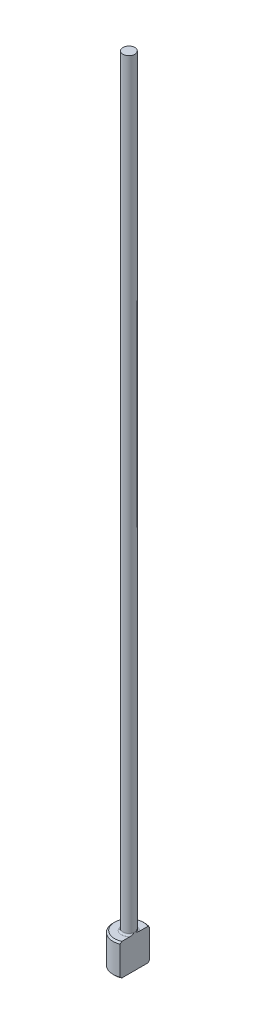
ISO-10303-21;
HEADER;
FILE_DESCRIPTION(('STEP AP214'),'2;1');
FILE_NAME('part.step','',(''),(''),'','','');
FILE_SCHEMA(('AUTOMOTIVE_DESIGN { 1 0 10303 214 1 1 1 1 }'));
ENDSEC;
DATA;
#1=APPLICATION_CONTEXT('core data for automotive mechanical design processes');
#2=APPLICATION_PROTOCOL_DEFINITION('international standard','automotive_design',2000,#1);
#3=PRODUCT_CONTEXT('',#1,'mechanical');
#4=PRODUCT('Part','Part','',(#3));
#5=PRODUCT_RELATED_PRODUCT_CATEGORY('part','',(#4));
#6=PRODUCT_DEFINITION_FORMATION('','',#4);
#7=PRODUCT_DEFINITION_CONTEXT('part definition',#1,'design');
#8=PRODUCT_DEFINITION('design','',#6,#7);
#9=PRODUCT_DEFINITION_SHAPE('','',#8);
#10=(LENGTH_UNIT() NAMED_UNIT(*) SI_UNIT(.MILLI.,.METRE.));
#11=(NAMED_UNIT(*) PLANE_ANGLE_UNIT() SI_UNIT($,.RADIAN.));
#12=(NAMED_UNIT(*) SI_UNIT($,.STERADIAN.) SOLID_ANGLE_UNIT());
#13=UNCERTAINTY_MEASURE_WITH_UNIT(LENGTH_MEASURE(1.E-05),#10,'distance_accuracy_value','');
#14=(GEOMETRIC_REPRESENTATION_CONTEXT(3) GLOBAL_UNCERTAINTY_ASSIGNED_CONTEXT((#13)) GLOBAL_UNIT_ASSIGNED_CONTEXT((#10,
#11,#12)) REPRESENTATION_CONTEXT('',''));
#15=CARTESIAN_POINT('',(0.,0.,0.));
#16=DIRECTION('',(0.,0.,1.));
#17=DIRECTION('',(1.,0.,0.));
#18=AXIS2_PLACEMENT_3D('',#15,#16,#17);
#19=CARTESIAN_POINT('',(0.,0.,0.));
#20=DIRECTION('',(0.,-1.,0.));
#21=DIRECTION('',(0.,0.,-1.));
#22=AXIS2_PLACEMENT_3D('',#19,#20,#21);
#23=PLANE('',#22);
#24=CARTESIAN_POINT('',(0.,0.,0.));
#25=DIRECTION('',(0.,-1.,0.));
#26=DIRECTION('',(0.,0.,-1.));
#27=AXIS2_PLACEMENT_3D('',#24,#25,#26);
#28=CIRCLE('',#27,1.79999999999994);
#29=CARTESIAN_POINT('',(0.749999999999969,0.,1.63630681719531));
#30=VERTEX_POINT('',#29);
#31=CARTESIAN_POINT('',(0.749999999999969,0.,-1.63630681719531));
#32=VERTEX_POINT('',#31);
#33=EDGE_CURVE('E98',#30,#32,#28,.T.);
#34=ORIENTED_EDGE('',*,*,#33,.T.);
#35=DIRECTION('',(0.,0.,1.));
#36=VECTOR('',#35,1.);
#37=CARTESIAN_POINT('',(0.749999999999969,0.,1.85404962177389));
#38=LINE('',#37,#36);
#39=EDGE_CURVE('E83',#32,#30,#38,.T.);
#40=ORIENTED_EDGE('',*,*,#39,.T.);
#41=EDGE_LOOP('',(#34,#40));
#42=FACE_BOUND('',#41,.T.);
#43=ADVANCED_FACE('F32',(#42),#23,.T.);
#44=CARTESIAN_POINT('',(0.,259.958771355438,0.));
#45=DIRECTION('',(0.,1.,0.));
#46=DIRECTION('',(0.,0.,1.));
#47=AXIS2_PLACEMENT_3D('',#44,#45,#46);
#48=CYLINDRICAL_SURFACE('',#47,1.99999999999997);
#49=CARTESIAN_POINT('',(0.,3.79999999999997,0.));
#50=DIRECTION('',(0.,1.,0.));
#51=DIRECTION('',(0.,0.,1.));
#52=AXIS2_PLACEMENT_3D('',#49,#50,#51);
#53=CIRCLE('',#52,1.99999999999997);
#54=CARTESIAN_POINT('',(0.749999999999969,3.79999999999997,1.85404962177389));
#55=VERTEX_POINT('',#54);
#56=CARTESIAN_POINT('',(0.749999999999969,3.79999999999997,-1.85404962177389));
#57=VERTEX_POINT('',#56);
#58=EDGE_CURVE('E104',#55,#57,#53,.F.);
#59=ORIENTED_EDGE('',*,*,#58,.T.);
#60=DIRECTION('',(0.,-1.,0.));
#61=VECTOR('',#60,1.);
#62=CARTESIAN_POINT('',(0.749999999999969,100.,-1.85404962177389));
#63=LINE('',#62,#61);
#64=CARTESIAN_POINT('',(0.749999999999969,0.200000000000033,-1.85404962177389));
#65=VERTEX_POINT('',#64);
#66=EDGE_CURVE('E183',#57,#65,#63,.T.);
#67=ORIENTED_EDGE('',*,*,#66,.T.);
#68=CARTESIAN_POINT('',(0.,0.200000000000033,0.));
#69=DIRECTION('',(0.,-1.,0.));
#70=DIRECTION('',(0.,0.,-1.));
#71=AXIS2_PLACEMENT_3D('',#68,#69,#70);
#72=CIRCLE('',#71,1.99999999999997);
#73=CARTESIAN_POINT('',(0.749999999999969,0.200000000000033,1.85404962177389));
#74=VERTEX_POINT('',#73);
#75=EDGE_CURVE('E100',#65,#74,#72,.F.);
#76=ORIENTED_EDGE('',*,*,#75,.T.);
#77=DIRECTION('',(0.,-1.,0.));
#78=VECTOR('',#77,1.);
#79=CARTESIAN_POINT('',(0.749999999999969,100.,1.85404962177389));
#80=LINE('',#79,#78);
#81=EDGE_CURVE('E93',#55,#74,#80,.T.);
#82=ORIENTED_EDGE('',*,*,#81,.F.);
#83=EDGE_LOOP('',(#59,#67,#76,#82));
#84=FACE_BOUND('',#83,.T.);
#85=ADVANCED_FACE('F158',(#84),#48,.T.);
#86=CARTESIAN_POINT('',(-1.99999999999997,4.,0.));
#87=DIRECTION('',(0.,1.,0.));
#88=DIRECTION('',(0.,0.,1.));
#89=AXIS2_PLACEMENT_3D('',#86,#87,#88);
#90=PLANE('',#89);
#91=CARTESIAN_POINT('',(0.,4.,0.));
#92=DIRECTION('',(0.,1.,0.));
#93=DIRECTION('',(0.,0.,1.));
#94=AXIS2_PLACEMENT_3D('',#91,#92,#93);
#95=CIRCLE('',#94,1.79999999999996);
#96=CARTESIAN_POINT('',(0.749999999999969,4.,-1.63630681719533));
#97=VERTEX_POINT('',#96);
#98=CARTESIAN_POINT('',(0.749999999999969,4.,1.63630681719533));
#99=VERTEX_POINT('',#98);
#100=EDGE_CURVE('E178',#97,#99,#95,.T.);
#101=ORIENTED_EDGE('',*,*,#100,.T.);
#102=DIRECTION('',(0.,0.,-1.));
#103=VECTOR('',#102,1.);
#104=CARTESIAN_POINT('',(0.749999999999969,4.,0.));
#105=LINE('',#104,#103);
#106=CARTESIAN_POINT('',(0.749999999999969,3.99999999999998,0.583095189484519));
#107=VERTEX_POINT('',#106);
#108=EDGE_CURVE('E57',#99,#107,#105,.T.);
#109=ORIENTED_EDGE('',*,*,#108,.T.);
#110=CARTESIAN_POINT('',(0.,4.,0.));
#111=DIRECTION('',(0.,1.,0.));
#112=DIRECTION('',(0.,0.,1.));
#113=AXIS2_PLACEMENT_3D('',#110,#111,#112);
#114=CIRCLE('',#113,0.949999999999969);
#115=CARTESIAN_POINT('',(0.749999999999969,3.99999999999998,-0.583095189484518));
#116=VERTEX_POINT('',#115);
#117=EDGE_CURVE('E107',#107,#116,#114,.F.);
#118=ORIENTED_EDGE('',*,*,#117,.T.);
#119=EDGE_CURVE('E136',#116,#97,#105,.T.);
#120=ORIENTED_EDGE('',*,*,#119,.T.);
#121=EDGE_LOOP('',(#101,#109,#118,#120));
#122=FACE_BOUND('',#121,.T.);
#123=ADVANCED_FACE('F147',(#122),#90,.T.);
#124=CARTESIAN_POINT('',(0.,4.,0.));
#125=DIRECTION('',(0.,-1.,0.));
#126=DIRECTION('',(0.,0.,-1.));
#127=AXIS2_PLACEMENT_3D('',#124,#125,#126);
#128=CONICAL_SURFACE('',#127,1.79999999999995,0.785398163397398);
#129=ORIENTED_EDGE('',*,*,#58,.F.);
#130=CARTESIAN_POINT('',(0.749999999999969,1.6493344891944,4.08234297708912));
#131=CARTESIAN_POINT('',(0.749999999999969,1.75686328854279,3.97300940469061));
#132=CARTESIAN_POINT('',(0.749999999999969,1.86432546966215,3.86361021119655));
#133=CARTESIAN_POINT('',(0.749999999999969,2.07918719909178,3.64450528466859));
#134=CARTESIAN_POINT('',(0.749999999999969,2.1865865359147,3.53479934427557));
#135=CARTESIAN_POINT('',(0.749999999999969,2.40330928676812,3.31294195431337));
#136=CARTESIAN_POINT('',(0.749999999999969,2.51262786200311,3.20078577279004));
#137=CARTESIAN_POINT('',(0.749999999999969,2.73079905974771,2.97627027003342));
#138=CARTESIAN_POINT('',(0.749999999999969,2.83965207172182,2.86391132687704));
#139=CARTESIAN_POINT('',(0.749999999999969,3.12410072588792,2.56910579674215));
#140=CARTESIAN_POINT('',(0.749999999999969,3.29932702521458,2.38630095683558));
#141=CARTESIAN_POINT('',(0.749999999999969,3.5608144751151,2.11005080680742));
#142=CARTESIAN_POINT('',(0.749999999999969,3.64793893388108,2.01742399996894));
#143=CARTESIAN_POINT('',(0.749999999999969,3.82126966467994,1.83139888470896));
#144=CARTESIAN_POINT('',(0.749999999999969,3.90747636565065,1.73800097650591));
#145=CARTESIAN_POINT('',(0.749999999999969,4.07705927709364,1.55161637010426));
#146=CARTESIAN_POINT('',(0.749999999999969,4.16045863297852,1.45865087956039));
#147=CARTESIAN_POINT('',(0.749999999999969,4.28399832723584,1.31767418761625));
#148=CARTESIAN_POINT('',(0.749999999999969,4.32495686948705,1.27038111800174));
#149=CARTESIAN_POINT('',(0.749999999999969,4.40612814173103,1.17516037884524));
#150=CARTESIAN_POINT('',(0.749999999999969,4.44634090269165,1.12723273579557));
#151=CARTESIAN_POINT('',(0.749999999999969,4.52542294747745,1.030920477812));
#152=CARTESIAN_POINT('',(0.749999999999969,4.56430041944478,0.982542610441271));
#153=CARTESIAN_POINT('',(0.749999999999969,4.64060877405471,0.884663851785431));
#154=CARTESIAN_POINT('',(0.749999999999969,4.67803993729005,0.835163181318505));
#155=CARTESIAN_POINT('',(0.749999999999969,4.7506421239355,0.734748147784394));
#156=CARTESIAN_POINT('',(0.749999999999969,4.78581957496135,0.683838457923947));
#157=CARTESIAN_POINT('',(0.749999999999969,4.8528147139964,0.579868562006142));
#158=CARTESIAN_POINT('',(0.749999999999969,4.88463648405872,0.52681108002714));
#159=CARTESIAN_POINT('',(0.749999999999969,4.92004236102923,0.460353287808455));
#160=CARTESIAN_POINT('',(0.749999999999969,4.92626425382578,0.44835537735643));
#161=CARTESIAN_POINT('',(0.749999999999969,4.93840821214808,0.42420502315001));
#162=CARTESIAN_POINT('',(0.749999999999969,4.94433019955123,0.412052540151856));
#163=CARTESIAN_POINT('',(0.749999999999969,4.96159246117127,0.375357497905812));
#164=CARTESIAN_POINT('',(0.749999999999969,4.97243059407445,0.350574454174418));
#165=CARTESIAN_POINT('',(0.749999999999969,4.99232429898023,0.300598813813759));
#166=CARTESIAN_POINT('',(0.749999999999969,5.00139743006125,0.27541327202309));
#167=CARTESIAN_POINT('',(0.749999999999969,5.01752532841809,0.22439193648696));
#168=CARTESIAN_POINT('',(0.749999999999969,5.02458006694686,0.198556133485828));
#169=CARTESIAN_POINT('',(0.749999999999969,5.03526259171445,0.150878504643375));
#170=CARTESIAN_POINT('',(0.749999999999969,5.03927292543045,0.129123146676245));
#171=CARTESIAN_POINT('',(0.749999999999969,5.0454699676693,0.0853625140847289));
#172=CARTESIAN_POINT('',(0.749999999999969,5.0476572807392,0.0633573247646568));
#173=CARTESIAN_POINT('',(0.749999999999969,5.05127090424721,-0.00270951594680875));
#174=CARTESIAN_POINT('',(0.749999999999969,5.04978253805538,-0.0469656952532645));
#175=CARTESIAN_POINT('',(0.749999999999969,5.03814860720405,-0.143936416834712));
#176=CARTESIAN_POINT('',(0.749999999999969,5.02621240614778,-0.196426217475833));
#177=CARTESIAN_POINT('',(0.749999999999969,5.00214641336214,-0.273272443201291));
#178=CARTESIAN_POINT('',(0.749999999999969,4.99304774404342,-0.298672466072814));
#179=CARTESIAN_POINT('',(0.749999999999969,4.97317462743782,-0.348806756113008));
#180=CARTESIAN_POINT('',(0.749999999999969,4.96240055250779,-0.373541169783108));
#181=CARTESIAN_POINT('',(0.749999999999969,4.92901260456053,-0.444792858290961));
#182=CARTESIAN_POINT('',(0.749999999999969,4.90460879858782,-0.490464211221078));
#183=CARTESIAN_POINT('',(0.749999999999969,4.85261191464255,-0.579972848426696));
#184=CARTESIAN_POINT('',(0.749999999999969,4.82501493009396,-0.623807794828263));
#185=CARTESIAN_POINT('',(0.749999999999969,4.76759807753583,-0.710209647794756));
#186=CARTESIAN_POINT('',(0.749999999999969,4.73777062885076,-0.752771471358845));
#187=CARTESIAN_POINT('',(0.749999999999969,4.67663657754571,-0.836824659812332));
#188=CARTESIAN_POINT('',(0.749999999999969,4.64532962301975,-0.878315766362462));
#189=CARTESIAN_POINT('',(0.749999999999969,4.58120898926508,-0.961064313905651));
#190=CARTESIAN_POINT('',(0.749999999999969,4.54838018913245,-1.00230998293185));
#191=CARTESIAN_POINT('',(0.749999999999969,4.48192435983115,-1.0841546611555));
#192=CARTESIAN_POINT('',(0.749999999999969,4.44829728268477,-1.12475363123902));
#193=CARTESIAN_POINT('',(0.749999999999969,4.34669509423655,-1.24559513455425));
#194=CARTESIAN_POINT('',(0.749999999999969,4.27783379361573,-1.32509096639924));
#195=CARTESIAN_POINT('',(0.749999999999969,4.10242211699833,-1.52396732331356));
#196=CARTESIAN_POINT('',(0.749999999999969,3.99494650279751,-1.64252540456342));
#197=CARTESIAN_POINT('',(0.749999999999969,3.7782504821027,-1.87804575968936));
#198=CARTESIAN_POINT('',(0.749999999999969,3.66902991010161,-1.9950078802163));
#199=CARTESIAN_POINT('',(0.749999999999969,3.449392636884,-2.22808772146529));
#200=CARTESIAN_POINT('',(0.749999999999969,3.33897457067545,-2.3442041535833));
#201=CARTESIAN_POINT('',(0.749999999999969,3.11746229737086,-2.57577975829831));
#202=CARTESIAN_POINT('',(0.749999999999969,3.00636811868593,-2.69123895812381));
#203=CARTESIAN_POINT('',(0.749999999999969,2.79171284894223,-2.91342601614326));
#204=CARTESIAN_POINT('',(0.749999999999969,2.6881840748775,-3.02018512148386));
#205=CARTESIAN_POINT('',(0.749999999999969,2.48083134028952,-3.23341885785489));
#206=CARTESIAN_POINT('',(0.749999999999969,2.37700737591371,-3.33989348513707));
#207=CARTESIAN_POINT('',(0.749999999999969,2.16930389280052,-3.5524591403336));
#208=CARTESIAN_POINT('',(0.749999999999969,2.06542472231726,-3.65855050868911));
#209=CARTESIAN_POINT('',(0.749999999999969,1.857495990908,-3.87056274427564));
#210=CARTESIAN_POINT('',(0.749999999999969,1.75344643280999,-3.97648361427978));
#211=CARTESIAN_POINT('',(0.749999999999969,1.6493344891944,-4.08234297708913));
#212=B_SPLINE_CURVE_WITH_KNOTS('',3,(#130,#131,#132,#133,#134,#135,#136,#137,#138,#139,#140,
#141,#142,#143,#144,#145,#146,#147,#148,#149,#150,#151,#152,#153,#154,#155,#156,#157,#158,#159,
#160,#161,#162,#163,#164,#165,#166,#167,#168,#169,#170,#171,#172,#173,#174,#175,#176,#177,#178,
#179,#180,#181,#182,#183,#184,#185,#186,#187,#188,#189,#190,#191,#192,#193,#194,#195,#196,#197,
#198,#199,#200,#201,#202,#203,#204,#205,#206,#207,#208,#209,#210,#211),.UNSPECIFIED.,.F.,.F.,(4,
2,2,2,2,2,2,2,2,2,2,2,2,2,2,2,2,2,2,2,2,2,2,2,2,2,2,2,2,2,2,2,2,2,2,2,2,2,2,2,4),(0.,
0.460050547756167,0.920626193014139,1.39048289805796,1.859803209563,2.61945882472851,
3.0009434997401,3.38224127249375,3.75689298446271,3.9445792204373,4.13225764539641,
4.31843090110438,4.50456785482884,4.69014785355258,4.87549943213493,4.91604145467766,
4.95659398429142,5.03768920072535,5.11793098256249,5.1981739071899,5.26446717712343,
5.33073845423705,5.46284570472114,5.62332534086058,5.7042256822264,5.78510806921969,
5.94023468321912,6.09555312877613,6.25142580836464,6.40733575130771,6.56546927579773,
6.72361232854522,7.03910022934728,7.51913300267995,7.99921158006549,8.47991142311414,
8.96059120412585,9.40673105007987,9.85287674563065,10.2983160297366,10.743747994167),.UNSPECIFIED.);
#213=EDGE_CURVE('E135',#55,#99,#212,.T.);
#214=ORIENTED_EDGE('',*,*,#213,.T.);
#215=ORIENTED_EDGE('',*,*,#100,.F.);
#216=EDGE_CURVE('E127',#97,#57,#212,.T.);
#217=ORIENTED_EDGE('',*,*,#216,.T.);
#218=EDGE_LOOP('',(#129,#214,#215,#217));
#219=FACE_BOUND('',#218,.T.);
#220=ADVANCED_FACE('F143',(#219),#128,.T.);
#221=CARTESIAN_POINT('',(0.,0.200000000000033,0.));
#222=DIRECTION('',(0.,1.,0.));
#223=DIRECTION('',(0.,0.,1.));
#224=AXIS2_PLACEMENT_3D('',#221,#222,#223);
#225=CONICAL_SURFACE('',#224,1.99999999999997,0.785398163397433);
#226=ORIENTED_EDGE('',*,*,#75,.F.);
#227=CARTESIAN_POINT('',(0.749999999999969,2.35066551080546,-4.08234297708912));
#228=CARTESIAN_POINT('',(0.749999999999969,2.24313671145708,-3.97300940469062));
#229=CARTESIAN_POINT('',(0.749999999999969,2.13567453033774,-3.86361021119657));
#230=CARTESIAN_POINT('',(0.749999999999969,1.92081280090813,-3.64450528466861));
#231=CARTESIAN_POINT('',(0.749999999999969,1.81341346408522,-3.5347993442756));
#232=CARTESIAN_POINT('',(0.749999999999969,1.59669071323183,-3.31294195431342));
#233=CARTESIAN_POINT('',(0.749999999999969,1.48737213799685,-3.20078577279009));
#234=CARTESIAN_POINT('',(0.749999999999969,1.26920094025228,-2.97627027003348));
#235=CARTESIAN_POINT('',(0.749999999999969,1.16034792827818,-2.86391132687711));
#236=CARTESIAN_POINT('',(0.749999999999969,0.875899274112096,-2.56910579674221));
#237=CARTESIAN_POINT('',(0.749999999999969,0.70067297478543,-2.38630095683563));
#238=CARTESIAN_POINT('',(0.749999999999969,0.439185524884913,-2.11005080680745));
#239=CARTESIAN_POINT('',(0.749999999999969,0.352061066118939,-2.01742399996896));
#240=CARTESIAN_POINT('',(0.749999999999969,0.178730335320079,-1.83139888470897));
#241=CARTESIAN_POINT('',(0.749999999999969,0.0925236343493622,-1.73800097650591));
#242=CARTESIAN_POINT('',(0.749999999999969,-0.077059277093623,-1.55161637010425));
#243=CARTESIAN_POINT('',(0.749999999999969,-0.160458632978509,-1.45865087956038));
#244=CARTESIAN_POINT('',(0.749999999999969,-0.283998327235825,-1.31767418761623));
#245=CARTESIAN_POINT('',(0.749999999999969,-0.324956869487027,-1.27038111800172));
#246=CARTESIAN_POINT('',(0.749999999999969,-0.406128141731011,-1.17516037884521));
#247=CARTESIAN_POINT('',(0.749999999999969,-0.446340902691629,-1.12723273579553));
#248=CARTESIAN_POINT('',(0.749999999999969,-0.525422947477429,-1.03092047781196));
#249=CARTESIAN_POINT('',(0.749999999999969,-0.56430041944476,-0.982542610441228));
#250=CARTESIAN_POINT('',(0.749999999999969,-0.640608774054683,-0.884663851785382));
#251=CARTESIAN_POINT('',(0.749999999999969,-0.678039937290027,-0.835163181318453));
#252=CARTESIAN_POINT('',(0.749999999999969,-0.750642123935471,-0.734748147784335));
#253=CARTESIAN_POINT('',(0.749999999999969,-0.785819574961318,-0.683838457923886));
#254=CARTESIAN_POINT('',(0.749999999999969,-0.852814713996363,-0.579868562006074));
#255=CARTESIAN_POINT('',(0.749999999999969,-0.884636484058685,-0.526811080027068));
#256=CARTESIAN_POINT('',(0.749999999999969,-0.920042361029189,-0.46035328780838));
#257=CARTESIAN_POINT('',(0.749999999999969,-0.926264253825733,-0.448355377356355));
#258=CARTESIAN_POINT('',(0.749999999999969,-0.938408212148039,-0.424205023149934));
#259=CARTESIAN_POINT('',(0.749999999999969,-0.94433019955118,-0.412052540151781));
#260=CARTESIAN_POINT('',(0.749999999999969,-0.961592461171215,-0.375357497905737));
#261=CARTESIAN_POINT('',(0.749999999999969,-0.972430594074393,-0.350574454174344));
#262=CARTESIAN_POINT('',(0.749999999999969,-0.992324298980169,-0.300598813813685));
#263=CARTESIAN_POINT('',(0.749999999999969,-1.00139743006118,-0.275413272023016));
#264=CARTESIAN_POINT('',(0.749999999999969,-1.01752532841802,-0.224391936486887));
#265=CARTESIAN_POINT('',(0.749999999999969,-1.02458006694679,-0.198556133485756));
#266=CARTESIAN_POINT('',(0.749999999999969,-1.03526259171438,-0.150878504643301));
#267=CARTESIAN_POINT('',(0.749999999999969,-1.03927292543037,-0.129123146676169));
#268=CARTESIAN_POINT('',(0.749999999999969,-1.04546996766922,-0.0853625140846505));
#269=CARTESIAN_POINT('',(0.749999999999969,-1.04765728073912,-0.063357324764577));
#270=CARTESIAN_POINT('',(0.749999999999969,-1.05127090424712,0.00270951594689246));
#271=CARTESIAN_POINT('',(0.749999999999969,-1.04978253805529,0.0469656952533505));
#272=CARTESIAN_POINT('',(0.749999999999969,-1.03814860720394,0.143936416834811));
#273=CARTESIAN_POINT('',(0.749999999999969,-1.02621240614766,0.196426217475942));
#274=CARTESIAN_POINT('',(0.749999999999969,-1.00214641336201,0.273272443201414));
#275=CARTESIAN_POINT('',(0.749999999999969,-0.993047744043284,0.298672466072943));
#276=CARTESIAN_POINT('',(0.749999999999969,-0.973174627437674,0.348806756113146));
#277=CARTESIAN_POINT('',(0.749999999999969,-0.962400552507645,0.373541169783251));
#278=CARTESIAN_POINT('',(0.749999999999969,-0.929012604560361,0.444792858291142));
#279=CARTESIAN_POINT('',(0.749999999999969,-0.904608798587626,0.490464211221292));
#280=CARTESIAN_POINT('',(0.749999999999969,-0.852611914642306,0.579972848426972));
#281=CARTESIAN_POINT('',(0.749999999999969,-0.825014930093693,0.623807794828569));
#282=CARTESIAN_POINT('',(0.749999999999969,-0.767598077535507,0.710209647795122));
#283=CARTESIAN_POINT('',(0.749999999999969,-0.737770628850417,0.75277147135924));
#284=CARTESIAN_POINT('',(0.749999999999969,-0.676636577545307,0.836824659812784));
#285=CARTESIAN_POINT('',(0.749999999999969,-0.645329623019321,0.878315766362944));
#286=CARTESIAN_POINT('',(0.749999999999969,-0.581208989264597,0.96106431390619));
#287=CARTESIAN_POINT('',(0.749999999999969,-0.548380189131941,1.00230998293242));
#288=CARTESIAN_POINT('',(0.749999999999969,-0.481924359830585,1.08415466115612));
#289=CARTESIAN_POINT('',(0.749999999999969,-0.448297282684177,1.12475363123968));
#290=CARTESIAN_POINT('',(0.749999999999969,-0.346695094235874,1.24559513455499));
#291=CARTESIAN_POINT('',(0.749999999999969,-0.277833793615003,1.32509096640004));
#292=CARTESIAN_POINT('',(0.749999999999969,-0.102422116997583,1.52396732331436));
#293=CARTESIAN_POINT('',(0.749999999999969,0.00505349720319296,1.64252540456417));
#294=CARTESIAN_POINT('',(0.749999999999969,0.221749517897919,1.87804575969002));
#295=CARTESIAN_POINT('',(0.749999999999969,0.330970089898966,1.99500788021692));
#296=CARTESIAN_POINT('',(0.749999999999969,0.55060736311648,2.22808772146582));
#297=CARTESIAN_POINT('',(0.749999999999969,0.661025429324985,2.34420415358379));
#298=CARTESIAN_POINT('',(0.749999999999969,0.88253770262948,2.57577975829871));
#299=CARTESIAN_POINT('',(0.749999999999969,0.993631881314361,2.69123895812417));
#300=CARTESIAN_POINT('',(0.749999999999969,1.20828715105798,2.91342601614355));
#301=CARTESIAN_POINT('',(0.749999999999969,1.31181592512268,3.02018512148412));
#302=CARTESIAN_POINT('',(0.749999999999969,1.5191686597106,3.2334188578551));
#303=CARTESIAN_POINT('',(0.749999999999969,1.62299262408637,3.33989348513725));
#304=CARTESIAN_POINT('',(0.749999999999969,1.8306961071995,3.55245914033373));
#305=CARTESIAN_POINT('',(0.749999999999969,1.93457527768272,3.65855050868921));
#306=CARTESIAN_POINT('',(0.749999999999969,2.14250400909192,3.87056274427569));
#307=CARTESIAN_POINT('',(0.749999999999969,2.2465535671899,3.9764836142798));
#308=CARTESIAN_POINT('',(0.749999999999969,2.35066551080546,4.08234297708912));
#309=B_SPLINE_CURVE_WITH_KNOTS('',3,(#227,#228,#229,#230,#231,#232,#233,#234,#235,#236,#237,
#238,#239,#240,#241,#242,#243,#244,#245,#246,#247,#248,#249,#250,#251,#252,#253,#254,#255,#256,
#257,#258,#259,#260,#261,#262,#263,#264,#265,#266,#267,#268,#269,#270,#271,#272,#273,#274,#275,
#276,#277,#278,#279,#280,#281,#282,#283,#284,#285,#286,#287,#288,#289,#290,#291,#292,#293,#294,
#295,#296,#297,#298,#299,#300,#301,#302,#303,#304,#305,#306,#307,#308),.UNSPECIFIED.,.F.,.F.,(4,
2,2,2,2,2,2,2,2,2,2,2,2,2,2,2,2,2,2,2,2,2,2,2,2,2,2,2,2,2,2,2,2,2,2,2,2,2,2,2,4),(0.,
0.460050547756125,0.920626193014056,1.39048289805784,1.85980320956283,2.61945882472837,
3.00094349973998,3.38224127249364,3.75689298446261,3.94457922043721,4.13225764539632,
4.3184309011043,4.50456785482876,4.69014785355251,4.87549943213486,4.91604145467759,
4.95659398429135,5.03768920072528,5.11793098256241,5.19817390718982,5.26446717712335,
5.33073845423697,5.46284570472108,5.62332534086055,5.70422568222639,5.7851080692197,
5.94023468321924,6.09555312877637,6.251425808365,6.40733575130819,6.56546927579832,
6.72361232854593,7.03910022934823,7.51913300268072,7.99921158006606,8.47991142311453,
8.96059120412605,9.40673105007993,9.85287674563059,10.2983160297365,10.7437479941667),.UNSPECIFIED.);
#310=EDGE_CURVE('E86',#65,#32,#309,.T.);
#311=ORIENTED_EDGE('',*,*,#310,.T.);
#312=ORIENTED_EDGE('',*,*,#33,.F.);
#313=EDGE_CURVE('E89',#30,#74,#309,.T.);
#314=ORIENTED_EDGE('',*,*,#313,.T.);
#315=EDGE_LOOP('',(#226,#311,#312,#314));
#316=FACE_BOUND('',#315,.T.);
#317=ADVANCED_FACE('F97',(#316),#225,.T.);
#318=CARTESIAN_POINT('',(0.,4.19999999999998,0.));
#319=DIRECTION('',(0.,1.,0.));
#320=DIRECTION('',(0.,0.,1.));
#321=AXIS2_PLACEMENT_3D('',#318,#319,#320);
#322=TOROIDAL_SURFACE('',#321,0.949999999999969,0.2);
#323=CARTESIAN_POINT('',(0.749999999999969,4.19999999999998,0.));
#324=CARTESIAN_POINT('',(0.749999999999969,4.20000052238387,0.));
#325=CARTESIAN_POINT('',(0.749999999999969,4.20000104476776,-7.92518434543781E-08));
#326=CARTESIAN_POINT('',(0.749999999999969,4.20000206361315,-3.453450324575E-07));
#327=CARTESIAN_POINT('',(0.749999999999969,4.20000255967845,-5.33493155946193E-07));
#328=CARTESIAN_POINT('',(0.749999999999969,4.20000354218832,-9.91557928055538E-07));
#329=CARTESIAN_POINT('',(0.749999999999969,4.20000402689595,-1.26510932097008E-06));
#330=CARTESIAN_POINT('',(0.749999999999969,4.20000495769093,-1.86638897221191E-06));
#331=CARTESIAN_POINT('',(0.749999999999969,4.20000540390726,-2.19392467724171E-06));
#332=CARTESIAN_POINT('',(0.749999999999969,4.20000683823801,-3.3337095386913E-06));
#333=CARTESIAN_POINT('',(0.749999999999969,4.20000776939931,-4.21820144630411E-06));
#334=CARTESIAN_POINT('',(0.749999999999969,4.20000948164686,-6.08403167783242E-06));
#335=CARTESIAN_POINT('',(0.749999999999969,4.20001026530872,-7.06314146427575E-06));
#336=CARTESIAN_POINT('',(0.749999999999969,4.20001305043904,-1.07283300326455E-05));
#337=CARTESIAN_POINT('',(0.749999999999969,4.20001489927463,-1.35334971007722E-05));
#338=CARTESIAN_POINT('',(0.749999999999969,4.20001806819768,-1.91887701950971E-05));
#339=CARTESIAN_POINT('',(0.749999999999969,4.20001941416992,-2.20250298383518E-05));
#340=CARTESIAN_POINT('',(0.749999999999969,4.20002483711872,-3.36357626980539E-05));
#341=CARTESIAN_POINT('',(0.749999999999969,4.20002876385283,-4.24755662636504E-05));
#342=CARTESIAN_POINT('',(0.749999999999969,4.20003535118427,-5.93015819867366E-05));
#343=CARTESIAN_POINT('',(0.749999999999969,4.20003811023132,-6.72480837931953E-05));
#344=CARTESIAN_POINT('',(0.749999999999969,4.20005910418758,-0.000122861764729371));
#345=CARTESIAN_POINT('',(0.749999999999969,4.2000847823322,-0.000167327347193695));
#346=CARTESIAN_POINT('',(0.749999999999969,4.20017912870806,-0.00033728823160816));
#347=CARTESIAN_POINT('',(0.749999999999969,4.20024226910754,-0.000465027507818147));
#348=CARTESIAN_POINT('',(0.749999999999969,4.20048606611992,-0.000950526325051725));
#349=CARTESIAN_POINT('',(0.749999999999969,4.20067249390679,-0.00130597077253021));
#350=CARTESIAN_POINT('',(0.749999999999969,4.20141452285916,-0.00272815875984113));
#351=CARTESIAN_POINT('',(0.749999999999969,4.20196367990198,-0.00379745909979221));
#352=CARTESIAN_POINT('',(0.749999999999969,4.21079317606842,-0.0209810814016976));
#353=CARTESIAN_POINT('',(0.749999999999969,4.21912708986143,-0.0370747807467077));
#354=CARTESIAN_POINT('',(0.749999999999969,4.23538169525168,-0.0687945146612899));
#355=CARTESIAN_POINT('',(0.749999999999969,4.24330692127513,-0.0844183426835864));
#356=CARTESIAN_POINT('',(0.749999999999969,4.25980152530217,-0.117412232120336));
#357=CARTESIAN_POINT('',(0.749999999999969,4.2683506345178,-0.134792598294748));
#358=CARTESIAN_POINT('',(0.749999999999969,4.28516256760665,-0.169887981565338));
#359=CARTESIAN_POINT('',(0.749999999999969,4.29342203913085,-0.187604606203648));
#360=CARTESIAN_POINT('',(0.749999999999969,4.31367684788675,-0.232718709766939));
#361=CARTESIAN_POINT('',(0.749999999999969,4.32533268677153,-0.260271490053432));
#362=CARTESIAN_POINT('',(0.749999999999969,4.34666110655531,-0.315501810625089));
#363=CARTESIAN_POINT('',(0.749999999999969,4.35636938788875,-0.343165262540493));
#364=CARTESIAN_POINT('',(0.749999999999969,4.37268127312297,-0.396748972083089));
#365=CARTESIAN_POINT('',(0.749999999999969,4.379483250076,-0.42260763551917));
#366=CARTESIAN_POINT('',(0.749999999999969,4.39076706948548,-0.476103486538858));
#367=CARTESIAN_POINT('',(0.749999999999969,4.39512718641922,-0.503767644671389));
#368=CARTESIAN_POINT('',(0.749999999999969,4.40012258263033,-0.559350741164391));
#369=CARTESIAN_POINT('',(0.749999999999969,4.40077276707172,-0.587268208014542));
#370=CARTESIAN_POINT('',(0.749999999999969,4.39725531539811,-0.642496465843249));
#371=CARTESIAN_POINT('',(0.749999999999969,4.39315871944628,-0.669810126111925));
#372=CARTESIAN_POINT('',(0.749999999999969,4.38226759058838,-0.710376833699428));
#373=CARTESIAN_POINT('',(0.749999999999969,4.37764112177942,-0.724213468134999));
#374=CARTESIAN_POINT('',(0.749999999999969,4.36645438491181,-0.751128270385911));
#375=CARTESIAN_POINT('',(0.749999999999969,4.3598916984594,-0.764205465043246));
#376=CARTESIAN_POINT('',(0.749999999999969,4.34591711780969,-0.787020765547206));
#377=CARTESIAN_POINT('',(0.749999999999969,4.33882518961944,-0.796953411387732));
#378=CARTESIAN_POINT('',(0.749999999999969,4.32312129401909,-0.815534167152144));
#379=CARTESIAN_POINT('',(0.749999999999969,4.31451194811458,-0.824184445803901));
#380=CARTESIAN_POINT('',(0.749999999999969,4.29770708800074,-0.838172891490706));
#381=CARTESIAN_POINT('',(0.749999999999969,4.2897756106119,-0.843827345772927));
#382=CARTESIAN_POINT('',(0.749999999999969,4.27308433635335,-0.853755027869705));
#383=CARTESIAN_POINT('',(0.749999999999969,4.26432487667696,-0.858028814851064));
#384=CARTESIAN_POINT('',(0.749999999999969,4.24611994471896,-0.864966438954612));
#385=CARTESIAN_POINT('',(0.749999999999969,4.23667052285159,-0.86762003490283));
#386=CARTESIAN_POINT('',(0.749999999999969,4.21743927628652,-0.871086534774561));
#387=CARTESIAN_POINT('',(0.749999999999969,4.207657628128,-0.871900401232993));
#388=CARTESIAN_POINT('',(0.749999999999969,4.18916476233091,-0.871644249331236));
#389=CARTESIAN_POINT('',(0.749999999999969,4.18045031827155,-0.870765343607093));
#390=CARTESIAN_POINT('',(0.749999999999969,4.16329782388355,-0.867547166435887));
#391=CARTESIAN_POINT('',(0.749999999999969,4.15485975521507,-0.865207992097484));
#392=CARTESIAN_POINT('',(0.749999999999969,4.138510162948,-0.859212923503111));
#393=CARTESIAN_POINT('',(0.749999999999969,4.13059660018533,-0.855562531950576));
#394=CARTESIAN_POINT('',(0.749999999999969,4.11540880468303,-0.847119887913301));
#395=CARTESIAN_POINT('',(0.749999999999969,4.10813470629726,-0.842327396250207));
#396=CARTESIAN_POINT('',(0.749999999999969,4.09350795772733,-0.831172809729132));
#397=CARTESIAN_POINT('',(0.749999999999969,4.08624574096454,-0.824692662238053));
#398=CARTESIAN_POINT('',(0.749999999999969,4.07268239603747,-0.810794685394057));
#399=CARTESIAN_POINT('',(0.749999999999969,4.06638225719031,-0.803375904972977));
#400=CARTESIAN_POINT('',(0.749999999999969,4.05147186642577,-0.783446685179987));
#401=CARTESIAN_POINT('',(0.749999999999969,4.04355238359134,-0.770417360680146));
#402=CARTESIAN_POINT('',(0.749999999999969,4.02991429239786,-0.743286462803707));
#403=CARTESIAN_POINT('',(0.749999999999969,4.02419651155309,-0.729184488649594));
#404=CARTESIAN_POINT('',(0.749999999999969,4.01257018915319,-0.693822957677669));
#405=CARTESIAN_POINT('',(0.749999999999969,4.00774380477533,-0.672209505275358));
#406=CARTESIAN_POINT('',(0.749999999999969,4.00145191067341,-0.628298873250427));
#407=CARTESIAN_POINT('',(0.749999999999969,4.0000267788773,-0.605996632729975));
#408=CARTESIAN_POINT('',(0.749999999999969,3.99995578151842,-0.54611119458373));
#409=CARTESIAN_POINT('',(0.749999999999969,4.00388309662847,-0.508527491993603));
#410=CARTESIAN_POINT('',(0.749999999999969,4.01373246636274,-0.453837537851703));
#411=CARTESIAN_POINT('',(0.749999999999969,4.01754666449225,-0.436272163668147));
#412=CARTESIAN_POINT('',(0.749999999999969,4.02621031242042,-0.401484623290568));
#413=CARTESIAN_POINT('',(0.749999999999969,4.03105449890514,-0.38426118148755));
#414=CARTESIAN_POINT('',(0.749999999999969,4.04486296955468,-0.339542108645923));
#415=CARTESIAN_POINT('',(0.749999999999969,4.05452531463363,-0.312264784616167));
#416=CARTESIAN_POINT('',(0.749999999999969,4.07570310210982,-0.257776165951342));
#417=CARTESIAN_POINT('',(0.749999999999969,4.08725400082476,-0.230578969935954));
#418=CARTESIAN_POINT('',(0.749999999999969,4.10733071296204,-0.185975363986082));
#419=CARTESIAN_POINT('',(0.749999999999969,4.11553018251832,-0.168419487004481));
#420=CARTESIAN_POINT('',(0.749999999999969,4.13221303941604,-0.133639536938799));
#421=CARTESIAN_POINT('',(0.749999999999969,4.14069316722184,-0.116413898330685));
#422=CARTESIAN_POINT('',(0.749999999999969,4.15705001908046,-0.0837133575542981));
#423=CARTESIAN_POINT('',(0.749999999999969,4.16490699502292,-0.0682284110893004));
#424=CARTESIAN_POINT('',(0.749999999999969,4.18101978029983,-0.0367899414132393));
#425=CARTESIAN_POINT('',(0.749999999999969,4.18928002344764,-0.0208385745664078));
#426=CARTESIAN_POINT('',(0.749999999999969,4.19803632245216,-0.00379745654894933));
#427=CARTESIAN_POINT('',(0.749999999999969,4.19858548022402,-0.00272815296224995));
#428=CARTESIAN_POINT('',(0.749999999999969,4.1993275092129,-0.00130596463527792));
#429=CARTESIAN_POINT('',(0.749999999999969,4.19951393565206,-0.000950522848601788));
#430=CARTESIAN_POINT('',(0.749999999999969,4.19975773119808,-0.000465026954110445));
#431=CARTESIAN_POINT('',(0.749999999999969,4.19982087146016,-0.00033728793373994));
#432=CARTESIAN_POINT('',(0.749999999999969,4.19991521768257,-0.000167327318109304));
#433=CARTESIAN_POINT('',(0.749999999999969,4.19994089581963,-0.000122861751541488));
#434=CARTESIAN_POINT('',(0.749999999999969,4.19996188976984,-6.72480870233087E-05));
#435=CARTESIAN_POINT('',(0.749999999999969,4.19996464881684,-5.93015850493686E-05));
#436=CARTESIAN_POINT('',(0.749999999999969,4.19997123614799,-4.24755688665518E-05));
#437=CARTESIAN_POINT('',(0.749999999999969,4.19997516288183,-3.36357649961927E-05));
#438=CARTESIAN_POINT('',(0.749999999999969,4.19998058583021,-2.20250315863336E-05));
#439=CARTESIAN_POINT('',(0.749999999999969,4.19998193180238,-1.91887717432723E-05));
#440=CARTESIAN_POINT('',(0.749999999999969,4.1999851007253,-1.35334982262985E-05));
#441=CARTESIAN_POINT('',(0.749999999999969,4.19998694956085,-1.07283309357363E-05));
#442=CARTESIAN_POINT('',(0.749999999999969,4.19998973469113,-7.06314207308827E-06));
#443=CARTESIAN_POINT('',(0.749999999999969,4.19999051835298,-6.08403221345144E-06));
#444=CARTESIAN_POINT('',(0.749999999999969,4.19999223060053,-4.21820183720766E-06));
#445=CARTESIAN_POINT('',(0.749999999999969,4.19999316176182,-3.33370985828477E-06));
#446=CARTESIAN_POINT('',(0.749999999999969,4.19999459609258,-2.19392490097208E-06));
#447=CARTESIAN_POINT('',(0.749999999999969,4.19999504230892,-1.86638916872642E-06));
#448=CARTESIAN_POINT('',(0.749999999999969,4.19999597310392,-1.26510946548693E-06));
#449=CARTESIAN_POINT('',(0.749999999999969,4.19999645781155,-9.91558047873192E-07));
#450=CARTESIAN_POINT('',(0.749999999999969,4.19999744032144,-5.33493231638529E-07));
#451=CARTESIAN_POINT('',(0.749999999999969,4.19999793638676,-3.45345088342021E-07));
#452=CARTESIAN_POINT('',(0.749999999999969,4.19999895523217,-7.92518659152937E-08));
#453=CARTESIAN_POINT('',(0.749999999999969,4.19999947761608,0.));
#454=CARTESIAN_POINT('',(0.749999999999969,4.19999999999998,0.));
#455=B_SPLINE_CURVE_WITH_KNOTS('',3,(#323,#324,#325,#326,#327,#328,#329,#330,#331,#332,#333,
#334,#335,#336,#337,#338,#339,#340,#341,#342,#343,#344,#345,#346,#347,#348,#349,#350,#351,#352,
#353,#354,#355,#356,#357,#358,#359,#360,#361,#362,#363,#364,#365,#366,#367,#368,#369,#370,#371,
#372,#373,#374,#375,#376,#377,#378,#379,#380,#381,#382,#383,#384,#385,#386,#387,#388,#389,#390,
#391,#392,#393,#394,#395,#396,#397,#398,#399,#400,#401,#402,#403,#404,#405,#406,#407,#408,#409,
#410,#411,#412,#413,#414,#415,#416,#417,#418,#419,#420,#421,#422,#423,#424,#425,#426,#427,#428,
#429,#430,#431,#432,#433,#434,#435,#436,#437,#438,#439,#440,#441,#442,#443,#444,#445,#446,#447,
#448,#449,#450,#451,#452,#453,#454),.UNSPECIFIED.,.T.,.F.,(4,2,2,2,2,2,2,2,2,2,2,2,2,2,2,2,2,2,
2,2,2,2,2,2,2,2,2,2,2,2,2,2,2,2,2,2,2,2,2,2,2,2,2,2,2,2,2,2,2,2,2,2,2,2,2,2,2,2,2,2,2,2,2,2,2,
4),(0.,1.56543919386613E-06,3.15006544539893E-06,4.81434341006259E-06,6.47280876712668E-06,
1.03067365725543E-05,1.40657946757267E-05,2.41046687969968E-05,3.35140856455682E-05,
6.25197195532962E-05,8.77289705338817E-05,0.000240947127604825,0.000669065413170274,
0.00187238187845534,0.00547938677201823,0.0598417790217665,0.112399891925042,0.170503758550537,
0.229141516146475,0.318850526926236,0.40672395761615,0.486842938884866,0.570663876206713,
0.654147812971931,0.736398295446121,0.780052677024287,0.823761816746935,0.860241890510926,
0.896659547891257,0.925764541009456,0.954857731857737,0.984132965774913,1.01339287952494,
1.03954157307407,1.06568852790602,1.09172701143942,1.11777095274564,1.14686281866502,
1.17598440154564,1.22146737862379,1.26696743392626,1.33303548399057,1.39988404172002,
1.51253340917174,1.56644503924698,1.62008752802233,1.70682485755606,1.79543193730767,
1.85355663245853,1.91115281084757,1.96324672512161,2.0171283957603,2.02073541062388,
2.0219387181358,2.02236683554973,2.02252005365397,2.02254526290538,2.02257426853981,
2.0225836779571,2.02259371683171,2.02259747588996,2.02260130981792,2.02260296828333,
2.02260463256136,2.02260621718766,2.0226077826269),.UNSPECIFIED.);
#456=CARTESIAN_POINT('',(0.749999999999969,4.19999999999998,0.));
#457=VERTEX_POINT('',#456);
#458=EDGE_CURVE('E11',#116,#457,#455,.T.);
#459=ORIENTED_EDGE('',*,*,#458,.F.);
#460=ORIENTED_EDGE('',*,*,#117,.F.);
#461=CARTESIAN_POINT('',(0.749999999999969,4.19999999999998,0.));
#462=CARTESIAN_POINT('',(0.749999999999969,4.19999947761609,0.));
#463=CARTESIAN_POINT('',(0.749999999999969,4.1999989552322,7.92518434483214E-08));
#464=CARTESIAN_POINT('',(0.749999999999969,4.19999793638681,3.45345032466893E-07));
#465=CARTESIAN_POINT('',(0.749999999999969,4.19999744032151,5.33493155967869E-07));
#466=CARTESIAN_POINT('',(0.749999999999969,4.19999645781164,9.91557928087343E-07));
#467=CARTESIAN_POINT('',(0.749999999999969,4.19999597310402,1.26510932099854E-06));
#468=CARTESIAN_POINT('',(0.749999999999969,4.19999504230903,1.86638897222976E-06));
#469=CARTESIAN_POINT('',(0.749999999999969,4.1999945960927,2.19392467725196E-06));
#470=CARTESIAN_POINT('',(0.749999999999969,4.19999316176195,3.33370953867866E-06));
#471=CARTESIAN_POINT('',(0.749999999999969,4.19999223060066,4.21820144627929E-06));
#472=CARTESIAN_POINT('',(0.749999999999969,4.1999905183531,6.08403167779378E-06));
#473=CARTESIAN_POINT('',(0.749999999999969,4.19998973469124,7.06314146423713E-06));
#474=CARTESIAN_POINT('',(0.749999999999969,4.19998694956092,1.07283300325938E-05));
#475=CARTESIAN_POINT('',(0.749999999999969,4.19998510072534,1.35334971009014E-05));
#476=CARTESIAN_POINT('',(0.749999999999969,4.19998193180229,1.91887701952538E-05));
#477=CARTESIAN_POINT('',(0.749999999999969,4.19998058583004,2.20250298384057E-05));
#478=CARTESIAN_POINT('',(0.749999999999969,4.19997516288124,3.36357626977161E-05));
#479=CARTESIAN_POINT('',(0.749999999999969,4.19997123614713,4.24755662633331E-05));
#480=CARTESIAN_POINT('',(0.749999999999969,4.19996464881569,5.93015819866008E-05));
#481=CARTESIAN_POINT('',(0.749999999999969,4.19996188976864,6.72480837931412E-05));
#482=CARTESIAN_POINT('',(0.749999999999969,4.19994089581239,0.000122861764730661));
#483=CARTESIAN_POINT('',(0.749999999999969,4.19991521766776,0.000167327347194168));
#484=CARTESIAN_POINT('',(0.749999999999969,4.19982087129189,0.000337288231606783));
#485=CARTESIAN_POINT('',(0.749999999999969,4.19975773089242,0.000465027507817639));
#486=CARTESIAN_POINT('',(0.749999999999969,4.19951393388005,0.000950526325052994));
#487=CARTESIAN_POINT('',(0.749999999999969,4.19932750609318,0.00130597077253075));
#488=CARTESIAN_POINT('',(0.749999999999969,4.1985854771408,0.00272815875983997));
#489=CARTESIAN_POINT('',(0.749999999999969,4.19803632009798,0.00379745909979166));
#490=CARTESIAN_POINT('',(0.749999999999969,4.18920682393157,0.0209810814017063));
#491=CARTESIAN_POINT('',(0.749999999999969,4.18087291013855,0.037074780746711));
#492=CARTESIAN_POINT('',(0.749999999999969,4.16461830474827,0.0687945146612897));
#493=CARTESIAN_POINT('',(0.749999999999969,4.15669307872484,0.084418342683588));
#494=CARTESIAN_POINT('',(0.749999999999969,4.14019847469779,0.117412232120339));
#495=CARTESIAN_POINT('',(0.749999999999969,4.13164936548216,0.13479259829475));
#496=CARTESIAN_POINT('',(0.749999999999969,4.11483743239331,0.169887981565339));
#497=CARTESIAN_POINT('',(0.749999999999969,4.10657796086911,0.187604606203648));
#498=CARTESIAN_POINT('',(0.749999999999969,4.08632315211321,0.232718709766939));
#499=CARTESIAN_POINT('',(0.749999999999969,4.07466731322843,0.260271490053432));
#500=CARTESIAN_POINT('',(0.749999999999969,4.05333889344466,0.315501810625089));
#501=CARTESIAN_POINT('',(0.749999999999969,4.04363061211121,0.343165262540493));
#502=CARTESIAN_POINT('',(0.749999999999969,4.02731872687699,0.396748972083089));
#503=CARTESIAN_POINT('',(0.749999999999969,4.02051674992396,0.42260763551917));
#504=CARTESIAN_POINT('',(0.749999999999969,4.00923293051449,0.476103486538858));
#505=CARTESIAN_POINT('',(0.749999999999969,4.00487281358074,0.503767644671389));
#506=CARTESIAN_POINT('',(0.749999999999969,3.99987741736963,0.559350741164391));
#507=CARTESIAN_POINT('',(0.749999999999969,3.99922723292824,0.587268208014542));
#508=CARTESIAN_POINT('',(0.749999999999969,4.00274468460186,0.642496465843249));
#509=CARTESIAN_POINT('',(0.749999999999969,4.00684128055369,0.669810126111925));
#510=CARTESIAN_POINT('',(0.749999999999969,4.01773240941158,0.710376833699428));
#511=CARTESIAN_POINT('',(0.749999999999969,4.02235887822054,0.724213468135));
#512=CARTESIAN_POINT('',(0.749999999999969,4.03354561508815,0.751128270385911));
#513=CARTESIAN_POINT('',(0.749999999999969,4.04010830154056,0.764205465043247));
#514=CARTESIAN_POINT('',(0.749999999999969,4.05408288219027,0.787020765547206));
#515=CARTESIAN_POINT('',(0.749999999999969,4.06117481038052,0.796953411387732));
#516=CARTESIAN_POINT('',(0.749999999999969,4.07687870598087,0.815534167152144));
#517=CARTESIAN_POINT('',(0.749999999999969,4.08548805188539,0.824184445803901));
#518=CARTESIAN_POINT('',(0.749999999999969,4.10229291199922,0.838172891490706));
#519=CARTESIAN_POINT('',(0.749999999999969,4.11022438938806,0.843827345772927));
#520=CARTESIAN_POINT('',(0.749999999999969,4.12691566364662,0.853755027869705));
#521=CARTESIAN_POINT('',(0.749999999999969,4.135675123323,0.858028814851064));
#522=CARTESIAN_POINT('',(0.749999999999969,4.153880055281,0.864966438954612));
#523=CARTESIAN_POINT('',(0.749999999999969,4.16332947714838,0.86762003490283));
#524=CARTESIAN_POINT('',(0.749999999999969,4.18256072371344,0.871086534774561));
#525=CARTESIAN_POINT('',(0.749999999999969,4.19234237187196,0.871900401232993));
#526=CARTESIAN_POINT('',(0.749999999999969,4.21083523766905,0.871644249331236));
#527=CARTESIAN_POINT('',(0.749999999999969,4.21954968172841,0.870765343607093));
#528=CARTESIAN_POINT('',(0.749999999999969,4.23670217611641,0.867547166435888));
#529=CARTESIAN_POINT('',(0.749999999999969,4.2451402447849,0.865207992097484));
#530=CARTESIAN_POINT('',(0.749999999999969,4.26148983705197,0.859212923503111));
#531=CARTESIAN_POINT('',(0.749999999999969,4.26940339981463,0.855562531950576));
#532=CARTESIAN_POINT('',(0.749999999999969,4.28459119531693,0.847119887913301));
#533=CARTESIAN_POINT('',(0.749999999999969,4.2918652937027,0.842327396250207));
#534=CARTESIAN_POINT('',(0.749999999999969,4.30649204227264,0.831172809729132));
#535=CARTESIAN_POINT('',(0.749999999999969,4.31375425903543,0.824692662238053));
#536=CARTESIAN_POINT('',(0.749999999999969,4.32731760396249,0.810794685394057));
#537=CARTESIAN_POINT('',(0.749999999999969,4.33361774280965,0.803375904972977));
#538=CARTESIAN_POINT('',(0.749999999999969,4.34852813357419,0.783446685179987));
#539=CARTESIAN_POINT('',(0.749999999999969,4.35644761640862,0.770417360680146));
#540=CARTESIAN_POINT('',(0.749999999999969,4.3700857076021,0.743286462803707));
#541=CARTESIAN_POINT('',(0.749999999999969,4.37580348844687,0.729184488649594));
#542=CARTESIAN_POINT('',(0.749999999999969,4.38742981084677,0.693822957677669));
#543=CARTESIAN_POINT('',(0.749999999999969,4.39225619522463,0.672209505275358));
#544=CARTESIAN_POINT('',(0.749999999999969,4.39854808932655,0.628298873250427));
#545=CARTESIAN_POINT('',(0.749999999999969,4.39997322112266,0.605996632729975));
#546=CARTESIAN_POINT('',(0.749999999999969,4.40004421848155,0.54611119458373));
#547=CARTESIAN_POINT('',(0.749999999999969,4.3961169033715,0.508527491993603));
#548=CARTESIAN_POINT('',(0.749999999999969,4.38626753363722,0.453837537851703));
#549=CARTESIAN_POINT('',(0.749999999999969,4.38245333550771,0.436272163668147));
#550=CARTESIAN_POINT('',(0.749999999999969,4.37378968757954,0.401484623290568));
#551=CARTESIAN_POINT('',(0.749999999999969,4.36894550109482,0.38426118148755));
#552=CARTESIAN_POINT('',(0.749999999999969,4.35513703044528,0.339542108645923));
#553=CARTESIAN_POINT('',(0.749999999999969,4.34547468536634,0.312264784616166));
#554=CARTESIAN_POINT('',(0.749999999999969,4.32429689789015,0.257776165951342));
#555=CARTESIAN_POINT('',(0.749999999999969,4.3127459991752,0.230578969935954));
#556=CARTESIAN_POINT('',(0.749999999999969,4.29266928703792,0.185975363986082));
#557=CARTESIAN_POINT('',(0.749999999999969,4.28446981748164,0.168419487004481));
#558=CARTESIAN_POINT('',(0.749999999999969,4.26778696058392,0.133639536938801));
#559=CARTESIAN_POINT('',(0.749999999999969,4.25930683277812,0.116413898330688));
#560=CARTESIAN_POINT('',(0.749999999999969,4.2429499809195,0.0837133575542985));
#561=CARTESIAN_POINT('',(0.749999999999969,4.23509300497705,0.0682284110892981));
#562=CARTESIAN_POINT('',(0.749999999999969,4.21898021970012,0.0367899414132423));
#563=CARTESIAN_POINT('',(0.749999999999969,4.2107199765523,0.020838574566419));
#564=CARTESIAN_POINT('',(0.749999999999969,4.20196367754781,0.00379745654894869));
#565=CARTESIAN_POINT('',(0.749999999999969,4.20141451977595,0.00272815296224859));
#566=CARTESIAN_POINT('',(0.749999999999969,4.20067249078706,0.00130596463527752));
#567=CARTESIAN_POINT('',(0.749999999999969,4.2004860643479,0.000950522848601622));
#568=CARTESIAN_POINT('',(0.749999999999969,4.20024226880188,0.00046502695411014));
#569=CARTESIAN_POINT('',(0.749999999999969,4.2001791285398,0.000337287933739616));
#570=CARTESIAN_POINT('',(0.749999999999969,4.20008478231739,0.000167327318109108));
#571=CARTESIAN_POINT('',(0.749999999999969,4.20005910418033,0.000122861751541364));
#572=CARTESIAN_POINT('',(0.749999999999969,4.20003811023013,6.72480870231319E-05));
#573=CARTESIAN_POINT('',(0.749999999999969,4.20003535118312,5.93015850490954E-05));
#574=CARTESIAN_POINT('',(0.749999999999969,4.20002876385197,4.24755688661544E-05));
#575=CARTESIAN_POINT('',(0.749999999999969,4.20002483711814,3.36357649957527E-05));
#576=CARTESIAN_POINT('',(0.749999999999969,4.20001941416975,2.20250315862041E-05));
#577=CARTESIAN_POINT('',(0.749999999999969,4.20001806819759,1.91887717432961E-05));
#578=CARTESIAN_POINT('',(0.749999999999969,4.20001489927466,1.35334982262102E-05));
#579=CARTESIAN_POINT('',(0.749999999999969,4.20001305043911,1.07283309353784E-05));
#580=CARTESIAN_POINT('',(0.749999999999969,4.20001026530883,7.06314207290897E-06));
#581=CARTESIAN_POINT('',(0.749999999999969,4.20000948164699,6.0840322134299E-06));
#582=CARTESIAN_POINT('',(0.749999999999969,4.20000776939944,4.21820183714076E-06));
#583=CARTESIAN_POINT('',(0.749999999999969,4.20000683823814,3.33370985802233E-06));
#584=CARTESIAN_POINT('',(0.749999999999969,4.20000540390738,2.1939249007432E-06));
#585=CARTESIAN_POINT('',(0.749999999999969,4.20000495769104,1.8663891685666E-06));
#586=CARTESIAN_POINT('',(0.749999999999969,4.20000402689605,1.26510946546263E-06));
#587=CARTESIAN_POINT('',(0.749999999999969,4.20000354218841,9.91558047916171E-07));
#588=CARTESIAN_POINT('',(0.749999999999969,4.20000255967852,5.33493231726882E-07));
#589=CARTESIAN_POINT('',(0.749999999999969,4.20000206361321,3.45345088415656E-07));
#590=CARTESIAN_POINT('',(0.749999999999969,4.20000104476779,7.92518659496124E-08));
#591=CARTESIAN_POINT('',(0.749999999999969,4.20000052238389,0.));
#592=CARTESIAN_POINT('',(0.749999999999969,4.19999999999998,0.));
#593=B_SPLINE_CURVE_WITH_KNOTS('',3,(#461,#462,#463,#464,#465,#466,#467,#468,#469,#470,#471,
#472,#473,#474,#475,#476,#477,#478,#479,#480,#481,#482,#483,#484,#485,#486,#487,#488,#489,#490,
#491,#492,#493,#494,#495,#496,#497,#498,#499,#500,#501,#502,#503,#504,#505,#506,#507,#508,#509,
#510,#511,#512,#513,#514,#515,#516,#517,#518,#519,#520,#521,#522,#523,#524,#525,#526,#527,#528,
#529,#530,#531,#532,#533,#534,#535,#536,#537,#538,#539,#540,#541,#542,#543,#544,#545,#546,#547,
#548,#549,#550,#551,#552,#553,#554,#555,#556,#557,#558,#559,#560,#561,#562,#563,#564,#565,#566,
#567,#568,#569,#570,#571,#572,#573,#574,#575,#576,#577,#578,#579,#580,#581,#582,#583,#584,#585,
#586,#587,#588,#589,#590,#591,#592),.UNSPECIFIED.,.T.,.F.,(4,2,2,2,2,2,2,2,2,2,2,2,2,2,2,2,2,2,
2,2,2,2,2,2,2,2,2,2,2,2,2,2,2,2,2,2,2,2,2,2,2,2,2,2,2,2,2,2,2,2,2,2,2,2,2,2,2,2,2,2,2,2,2,2,2,
4),(0.,1.5654391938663E-06,3.15006544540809E-06,4.81434341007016E-06,6.4728087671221E-06,
1.03067365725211E-05,1.40657946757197E-05,2.41046687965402E-05,3.35140856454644E-05,
6.25197195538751E-05,8.77289705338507E-05,0.000240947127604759,0.000669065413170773,
0.00187238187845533,0.00547938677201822,0.0598417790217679,0.112399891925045,0.170503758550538,
0.229141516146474,0.318850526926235,0.40672395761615,0.486842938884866,0.570663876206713,
0.654147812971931,0.736398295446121,0.780052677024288,0.823761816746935,0.860241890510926,
0.896659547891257,0.925764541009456,0.954857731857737,0.984132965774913,1.01339287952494,
1.03954157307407,1.06568852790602,1.09172701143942,1.11777095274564,1.14686281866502,
1.17598440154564,1.22146737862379,1.26696743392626,1.33303548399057,1.39988404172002,
1.51253340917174,1.56644503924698,1.62008752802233,1.70682485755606,1.79543193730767,
1.85355663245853,1.91115281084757,1.96324672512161,2.0171283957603,2.02073541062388,
2.0219387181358,2.02236683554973,2.02252005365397,2.02254526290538,2.02257426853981,
2.0225836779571,2.02259371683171,2.02259747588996,2.02260130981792,2.02260296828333,
2.02260463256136,2.02260621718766,2.0226077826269),.UNSPECIFIED.);
#594=EDGE_CURVE('E46',#457,#107,#593,.T.);
#595=ORIENTED_EDGE('',*,*,#594,.F.);
#596=CARTESIAN_POINT('',(0.,4.19999999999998,0.));
#597=DIRECTION('',(0.,1.,0.));
#598=DIRECTION('',(0.,0.,1.));
#599=AXIS2_PLACEMENT_3D('',#596,#597,#598);
#600=CIRCLE('',#599,0.749999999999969);
#601=EDGE_CURVE('E103',#457,#457,#600,.T.);
#602=ORIENTED_EDGE('',*,*,#601,.F.);
#603=EDGE_LOOP('',(#459,#460,#595,#602));
#604=FACE_BOUND('',#603,.T.);
#605=ADVANCED_FACE('F34',(#604),#322,.F.);
#606=CARTESIAN_POINT('',(0.,259.958771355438,0.));
#607=DIRECTION('',(0.,1.,0.));
#608=DIRECTION('',(0.,0.,1.));
#609=AXIS2_PLACEMENT_3D('',#606,#607,#608);
#610=CYLINDRICAL_SURFACE('',#609,0.749999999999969);
#611=ORIENTED_EDGE('',*,*,#601,.T.);
#612=EDGE_LOOP('',(#611));
#613=FACE_BOUND('',#612,.T.);
#614=CARTESIAN_POINT('',(0.,100.,0.));
#615=DIRECTION('',(0.,1.,0.));
#616=DIRECTION('',(0.,0.,1.));
#617=AXIS2_PLACEMENT_3D('',#614,#615,#616);
#618=CIRCLE('',#617,0.749999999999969);
#619=CARTESIAN_POINT('',(0.,100.,0.749999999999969));
#620=VERTEX_POINT('',#619);
#621=EDGE_CURVE('E101',#620,#620,#618,.T.);
#622=ORIENTED_EDGE('',*,*,#621,.F.);
#623=EDGE_LOOP('',(#622));
#624=FACE_BOUND('',#623,.T.);
#625=ADVANCED_FACE('F155',(#613,#624),#610,.T.);
#626=CARTESIAN_POINT('',(-0.749999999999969,100.,0.));
#627=DIRECTION('',(0.,1.,0.));
#628=DIRECTION('',(0.,0.,1.));
#629=AXIS2_PLACEMENT_3D('',#626,#627,#628);
#630=PLANE('',#629);
#631=ORIENTED_EDGE('',*,*,#621,.T.);
#632=EDGE_LOOP('',(#631));
#633=FACE_BOUND('',#632,.T.);
#634=ADVANCED_FACE('F121',(#633),#630,.T.);
#635=CARTESIAN_POINT('',(0.749999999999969,100.,1.85404962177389));
#636=DIRECTION('',(1.,0.,0.));
#637=DIRECTION('',(0.,0.,-1.));
#638=AXIS2_PLACEMENT_3D('',#635,#636,#637);
#639=PLANE('',#638);
#640=ORIENTED_EDGE('',*,*,#66,.F.);
#641=ORIENTED_EDGE('',*,*,#216,.F.);
#642=ORIENTED_EDGE('',*,*,#119,.F.);
#643=ORIENTED_EDGE('',*,*,#458,.T.);
#644=ORIENTED_EDGE('',*,*,#594,.T.);
#645=ORIENTED_EDGE('',*,*,#108,.F.);
#646=ORIENTED_EDGE('',*,*,#213,.F.);
#647=ORIENTED_EDGE('',*,*,#81,.T.);
#648=ORIENTED_EDGE('',*,*,#313,.F.);
#649=ORIENTED_EDGE('',*,*,#39,.F.);
#650=ORIENTED_EDGE('',*,*,#310,.F.);
#651=EDGE_LOOP('',(#640,#641,#642,#643,#644,#645,#646,#647,#648,#649,#650));
#652=FACE_BOUND('',#651,.T.);
#653=ADVANCED_FACE('F85',(#652),#639,.T.);
#654=CLOSED_SHELL('',(#43,#85,#123,#220,#317,#605,#625,#634,#653));
#655=MANIFOLD_SOLID_BREP('B2',#654);
#656=ADVANCED_BREP_SHAPE_REPRESENTATION('',(#18,#655),#14);
#657=SHAPE_DEFINITION_REPRESENTATION(#9,#656);
ENDSEC;
END-ISO-10303-21;
